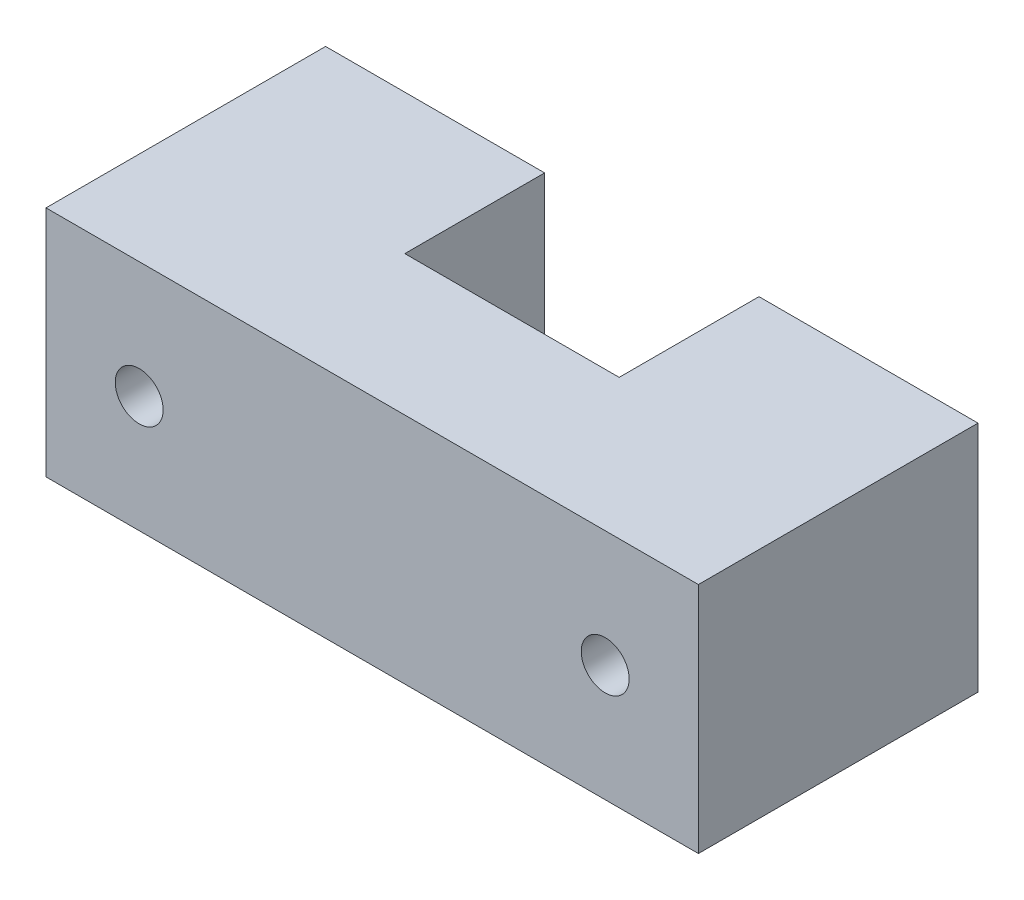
ISO-10303-21;
HEADER;
FILE_DESCRIPTION(('STEP AP214'),'2;1');
FILE_NAME('part.step','',(''),(''),'','','');
FILE_SCHEMA(('AUTOMOTIVE_DESIGN { 1 0 10303 214 1 1 1 1 }'));
ENDSEC;
DATA;
#1=APPLICATION_CONTEXT('core data for automotive mechanical design processes');
#2=APPLICATION_PROTOCOL_DEFINITION('international standard','automotive_design',2000,#1);
#3=PRODUCT_CONTEXT('',#1,'mechanical');
#4=PRODUCT('Part','Part','',(#3));
#5=PRODUCT_RELATED_PRODUCT_CATEGORY('part','',(#4));
#6=PRODUCT_DEFINITION_FORMATION('','',#4);
#7=PRODUCT_DEFINITION_CONTEXT('part definition',#1,'design');
#8=PRODUCT_DEFINITION('design','',#6,#7);
#9=PRODUCT_DEFINITION_SHAPE('','',#8);
#10=(LENGTH_UNIT() NAMED_UNIT(*) SI_UNIT(.MILLI.,.METRE.));
#11=(NAMED_UNIT(*) PLANE_ANGLE_UNIT() SI_UNIT($,.RADIAN.));
#12=(NAMED_UNIT(*) SI_UNIT($,.STERADIAN.) SOLID_ANGLE_UNIT());
#13=UNCERTAINTY_MEASURE_WITH_UNIT(LENGTH_MEASURE(1.E-05),#10,'distance_accuracy_value','');
#14=(GEOMETRIC_REPRESENTATION_CONTEXT(3) GLOBAL_UNCERTAINTY_ASSIGNED_CONTEXT((#13)) GLOBAL_UNIT_ASSIGNED_CONTEXT((#10,
#11,#12)) REPRESENTATION_CONTEXT('',''));
#15=CARTESIAN_POINT('',(0.,0.,0.));
#16=DIRECTION('',(0.,0.,1.));
#17=DIRECTION('',(1.,0.,0.));
#18=AXIS2_PLACEMENT_3D('',#15,#16,#17);
#19=CARTESIAN_POINT('',(0.,0.,0.));
#20=DIRECTION('',(0.,0.,1.));
#21=DIRECTION('',(1.,0.,0.));
#22=AXIS2_PLACEMENT_3D('',#19,#20,#21);
#23=PLANE('',#22);
#24=CARTESIAN_POINT('',(31.75,0.,0.));
#25=DIRECTION('',(0.,0.,1.));
#26=DIRECTION('',(1.,0.,0.));
#27=AXIS2_PLACEMENT_3D('',#24,#25,#26);
#28=CIRCLE('',#27,3.26389999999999);
#29=CARTESIAN_POINT('',(35.0139,0.,0.));
#30=VERTEX_POINT('',#29);
#31=EDGE_CURVE('E155',#30,#30,#28,.T.);
#32=ORIENTED_EDGE('',*,*,#31,.T.);
#33=EDGE_LOOP('',(#32));
#34=FACE_BOUND('',#33,.T.);
#35=DIRECTION('',(1.,0.,0.));
#36=VECTOR('',#35,1.);
#37=CARTESIAN_POINT('',(-44.45,-15.875,0.));
#38=LINE('',#37,#36);
#39=CARTESIAN_POINT('',(14.605,-15.875,0.));
#40=VERTEX_POINT('',#39);
#41=CARTESIAN_POINT('',(44.45,-15.875,0.));
#42=VERTEX_POINT('',#41);
#43=EDGE_CURVE('E78',#40,#42,#38,.T.);
#44=ORIENTED_EDGE('',*,*,#43,.F.);
#45=DIRECTION('',(0.,1.,0.));
#46=VECTOR('',#45,1.);
#47=CARTESIAN_POINT('',(14.605,-15.875,0.));
#48=LINE('',#47,#46);
#49=CARTESIAN_POINT('',(14.605,15.875,0.));
#50=VERTEX_POINT('',#49);
#51=EDGE_CURVE('E107',#40,#50,#48,.T.);
#52=ORIENTED_EDGE('',*,*,#51,.T.);
#53=DIRECTION('',(-1.,0.,0.));
#54=VECTOR('',#53,1.);
#55=CARTESIAN_POINT('',(-44.45,15.875,0.));
#56=LINE('',#55,#54);
#57=CARTESIAN_POINT('',(44.45,15.875,0.));
#58=VERTEX_POINT('',#57);
#59=EDGE_CURVE('E130',#58,#50,#56,.T.);
#60=ORIENTED_EDGE('',*,*,#59,.F.);
#61=DIRECTION('',(0.,1.,0.));
#62=VECTOR('',#61,1.);
#63=CARTESIAN_POINT('',(44.45,15.875,0.));
#64=LINE('',#63,#62);
#65=EDGE_CURVE('E124',#42,#58,#64,.T.);
#66=ORIENTED_EDGE('',*,*,#65,.F.);
#67=EDGE_LOOP('',(#44,#52,#60,#66));
#68=FACE_BOUND('',#67,.T.);
#69=ADVANCED_FACE('F33',(#34,#68),#23,.F.);
#70=CARTESIAN_POINT('',(44.45,15.875,38.1));
#71=DIRECTION('',(-1.,0.,0.));
#72=DIRECTION('',(0.,0.,1.));
#73=AXIS2_PLACEMENT_3D('',#70,#71,#72);
#74=PLANE('',#73);
#75=ORIENTED_EDGE('',*,*,#65,.T.);
#76=DIRECTION('',(0.,0.,-1.));
#77=VECTOR('',#76,1.);
#78=CARTESIAN_POINT('',(44.45,15.875,38.1));
#79=LINE('',#78,#77);
#80=CARTESIAN_POINT('',(44.45,15.875,38.1));
#81=VERTEX_POINT('',#80);
#82=EDGE_CURVE('E11',#81,#58,#79,.T.);
#83=ORIENTED_EDGE('',*,*,#82,.F.);
#84=DIRECTION('',(0.,1.,0.));
#85=VECTOR('',#84,1.);
#86=CARTESIAN_POINT('',(44.45,15.875,38.1));
#87=LINE('',#86,#85);
#88=CARTESIAN_POINT('',(44.45,-15.875,38.1));
#89=VERTEX_POINT('',#88);
#90=EDGE_CURVE('E129',#89,#81,#87,.T.);
#91=ORIENTED_EDGE('',*,*,#90,.F.);
#92=DIRECTION('',(0.,0.,-1.));
#93=VECTOR('',#92,1.);
#94=CARTESIAN_POINT('',(44.45,-15.875,38.1));
#95=LINE('',#94,#93);
#96=EDGE_CURVE('E134',#89,#42,#95,.T.);
#97=ORIENTED_EDGE('',*,*,#96,.T.);
#98=EDGE_LOOP('',(#75,#83,#91,#97));
#99=FACE_BOUND('',#98,.T.);
#100=ADVANCED_FACE('F35',(#99),#74,.F.);
#101=CARTESIAN_POINT('',(-44.45,15.875,38.1));
#102=DIRECTION('',(0.,-1.,0.));
#103=DIRECTION('',(0.,0.,-1.));
#104=AXIS2_PLACEMENT_3D('',#101,#102,#103);
#105=PLANE('',#104);
#106=ORIENTED_EDGE('',*,*,#59,.T.);
#107=DIRECTION('',(0.,0.,-1.));
#108=VECTOR('',#107,1.);
#109=CARTESIAN_POINT('',(14.605,15.875,19.05));
#110=LINE('',#109,#108);
#111=CARTESIAN_POINT('',(14.605,15.875,19.05));
#112=VERTEX_POINT('',#111);
#113=EDGE_CURVE('E112',#112,#50,#110,.T.);
#114=ORIENTED_EDGE('',*,*,#113,.F.);
#115=DIRECTION('',(1.,0.,0.));
#116=VECTOR('',#115,1.);
#117=CARTESIAN_POINT('',(-14.605,15.875,19.05));
#118=LINE('',#117,#116);
#119=CARTESIAN_POINT('',(-14.605,15.875,19.05));
#120=VERTEX_POINT('',#119);
#121=EDGE_CURVE('E120',#120,#112,#118,.T.);
#122=ORIENTED_EDGE('',*,*,#121,.F.);
#123=DIRECTION('',(0.,0.,1.));
#124=VECTOR('',#123,1.);
#125=CARTESIAN_POINT('',(-14.605,15.875,19.05));
#126=LINE('',#125,#124);
#127=CARTESIAN_POINT('',(-14.605,15.875,0.));
#128=VERTEX_POINT('',#127);
#129=EDGE_CURVE('E160',#128,#120,#126,.T.);
#130=ORIENTED_EDGE('',*,*,#129,.F.);
#131=CARTESIAN_POINT('',(-44.45,15.875,0.));
#132=VERTEX_POINT('',#131);
#133=EDGE_CURVE('E149',#128,#132,#56,.T.);
#134=ORIENTED_EDGE('',*,*,#133,.T.);
#135=DIRECTION('',(0.,0.,-1.));
#136=VECTOR('',#135,1.);
#137=CARTESIAN_POINT('',(-44.45,15.875,38.1));
#138=LINE('',#137,#136);
#139=CARTESIAN_POINT('',(-44.45,15.875,38.1));
#140=VERTEX_POINT('',#139);
#141=EDGE_CURVE('E41',#140,#132,#138,.T.);
#142=ORIENTED_EDGE('',*,*,#141,.F.);
#143=DIRECTION('',(-1.,0.,0.));
#144=VECTOR('',#143,1.);
#145=CARTESIAN_POINT('',(-44.45,15.875,38.1));
#146=LINE('',#145,#144);
#147=EDGE_CURVE('E85',#81,#140,#146,.T.);
#148=ORIENTED_EDGE('',*,*,#147,.F.);
#149=ORIENTED_EDGE('',*,*,#82,.T.);
#150=EDGE_LOOP('',(#106,#114,#122,#130,#134,#142,#148,#149));
#151=FACE_BOUND('',#150,.T.);
#152=ADVANCED_FACE('F157',(#151),#105,.F.);
#153=CARTESIAN_POINT('',(-44.45,15.875,38.1));
#154=DIRECTION('',(1.,0.,0.));
#155=DIRECTION('',(0.,0.,-1.));
#156=AXIS2_PLACEMENT_3D('',#153,#154,#155);
#157=PLANE('',#156);
#158=DIRECTION('',(0.,-1.,0.));
#159=VECTOR('',#158,1.);
#160=CARTESIAN_POINT('',(-44.45,15.875,0.));
#161=LINE('',#160,#159);
#162=CARTESIAN_POINT('',(-44.45,-15.875,0.));
#163=VERTEX_POINT('',#162);
#164=EDGE_CURVE('E126',#132,#163,#161,.T.);
#165=ORIENTED_EDGE('',*,*,#164,.T.);
#166=DIRECTION('',(0.,0.,-1.));
#167=VECTOR('',#166,1.);
#168=CARTESIAN_POINT('',(-44.45,-15.875,38.1));
#169=LINE('',#168,#167);
#170=CARTESIAN_POINT('',(-44.45,-15.875,38.1));
#171=VERTEX_POINT('',#170);
#172=EDGE_CURVE('E136',#171,#163,#169,.T.);
#173=ORIENTED_EDGE('',*,*,#172,.F.);
#174=DIRECTION('',(0.,-1.,0.));
#175=VECTOR('',#174,1.);
#176=CARTESIAN_POINT('',(-44.45,15.875,38.1));
#177=LINE('',#176,#175);
#178=EDGE_CURVE('E144',#140,#171,#177,.T.);
#179=ORIENTED_EDGE('',*,*,#178,.F.);
#180=ORIENTED_EDGE('',*,*,#141,.T.);
#181=EDGE_LOOP('',(#165,#173,#179,#180));
#182=FACE_BOUND('',#181,.T.);
#183=ADVANCED_FACE('F142',(#182),#157,.F.);
#184=CARTESIAN_POINT('',(-44.45,-15.875,38.1));
#185=DIRECTION('',(0.,1.,0.));
#186=DIRECTION('',(0.,0.,1.));
#187=AXIS2_PLACEMENT_3D('',#184,#185,#186);
#188=PLANE('',#187);
#189=DIRECTION('',(1.,0.,0.));
#190=VECTOR('',#189,1.);
#191=CARTESIAN_POINT('',(-14.605,-15.875,19.05));
#192=LINE('',#191,#190);
#193=CARTESIAN_POINT('',(-14.605,-15.875,19.05));
#194=VERTEX_POINT('',#193);
#195=CARTESIAN_POINT('',(14.605,-15.875,19.05));
#196=VERTEX_POINT('',#195);
#197=EDGE_CURVE('E116',#194,#196,#192,.T.);
#198=ORIENTED_EDGE('',*,*,#197,.T.);
#199=DIRECTION('',(0.,0.,-1.));
#200=VECTOR('',#199,1.);
#201=CARTESIAN_POINT('',(14.605,-15.875,19.05));
#202=LINE('',#201,#200);
#203=EDGE_CURVE('E109',#196,#40,#202,.T.);
#204=ORIENTED_EDGE('',*,*,#203,.T.);
#205=ORIENTED_EDGE('',*,*,#43,.T.);
#206=ORIENTED_EDGE('',*,*,#96,.F.);
#207=DIRECTION('',(1.,0.,0.));
#208=VECTOR('',#207,1.);
#209=CARTESIAN_POINT('',(-44.45,-15.875,38.1));
#210=LINE('',#209,#208);
#211=EDGE_CURVE('E57',#171,#89,#210,.T.);
#212=ORIENTED_EDGE('',*,*,#211,.F.);
#213=ORIENTED_EDGE('',*,*,#172,.T.);
#214=CARTESIAN_POINT('',(-14.605,-15.875,0.));
#215=VERTEX_POINT('',#214);
#216=EDGE_CURVE('E125',#163,#215,#38,.T.);
#217=ORIENTED_EDGE('',*,*,#216,.T.);
#218=DIRECTION('',(0.,0.,1.));
#219=VECTOR('',#218,1.);
#220=CARTESIAN_POINT('',(-14.605,-15.875,19.05));
#221=LINE('',#220,#219);
#222=EDGE_CURVE('E48',#215,#194,#221,.T.);
#223=ORIENTED_EDGE('',*,*,#222,.T.);
#224=EDGE_LOOP('',(#198,#204,#205,#206,#212,#213,#217,#223));
#225=FACE_BOUND('',#224,.T.);
#226=ADVANCED_FACE('F118',(#225),#188,.F.);
#227=CARTESIAN_POINT('',(0.,0.,38.1));
#228=DIRECTION('',(0.,0.,1.));
#229=DIRECTION('',(1.,0.,0.));
#230=AXIS2_PLACEMENT_3D('',#227,#228,#229);
#231=PLANE('',#230);
#232=CARTESIAN_POINT('',(-31.75,0.,38.1));
#233=DIRECTION('',(0.,0.,1.));
#234=DIRECTION('',(1.,0.,0.));
#235=AXIS2_PLACEMENT_3D('',#232,#233,#234);
#236=CIRCLE('',#235,3.2639);
#237=CARTESIAN_POINT('',(-28.4861,0.,38.1));
#238=VERTEX_POINT('',#237);
#239=EDGE_CURVE('E169',#238,#238,#236,.T.);
#240=ORIENTED_EDGE('',*,*,#239,.F.);
#241=EDGE_LOOP('',(#240));
#242=FACE_BOUND('',#241,.T.);
#243=CARTESIAN_POINT('',(31.75,0.,38.1));
#244=DIRECTION('',(0.,0.,1.));
#245=DIRECTION('',(1.,0.,0.));
#246=AXIS2_PLACEMENT_3D('',#243,#244,#245);
#247=CIRCLE('',#246,3.2639);
#248=CARTESIAN_POINT('',(35.0139,0.,38.1));
#249=VERTEX_POINT('',#248);
#250=EDGE_CURVE('E178',#249,#249,#247,.T.);
#251=ORIENTED_EDGE('',*,*,#250,.F.);
#252=EDGE_LOOP('',(#251));
#253=FACE_BOUND('',#252,.T.);
#254=ORIENTED_EDGE('',*,*,#90,.T.);
#255=ORIENTED_EDGE('',*,*,#147,.T.);
#256=ORIENTED_EDGE('',*,*,#178,.T.);
#257=ORIENTED_EDGE('',*,*,#211,.T.);
#258=EDGE_LOOP('',(#254,#255,#256,#257));
#259=FACE_BOUND('',#258,.T.);
#260=ADVANCED_FACE('F183',(#242,#253,#259),#231,.T.);
#261=CARTESIAN_POINT('',(-31.75,0.,0.));
#262=DIRECTION('',(0.,0.,1.));
#263=DIRECTION('',(1.,0.,0.));
#264=AXIS2_PLACEMENT_3D('',#261,#262,#263);
#265=CIRCLE('',#264,3.26389999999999);
#266=CARTESIAN_POINT('',(-28.4861,0.,0.));
#267=VERTEX_POINT('',#266);
#268=EDGE_CURVE('E175',#267,#267,#265,.T.);
#269=ORIENTED_EDGE('',*,*,#268,.T.);
#270=EDGE_LOOP('',(#269));
#271=FACE_BOUND('',#270,.T.);
#272=ORIENTED_EDGE('',*,*,#133,.F.);
#273=DIRECTION('',(0.,1.,0.));
#274=VECTOR('',#273,1.);
#275=CARTESIAN_POINT('',(-14.605,-15.875,0.));
#276=LINE('',#275,#274);
#277=EDGE_CURVE('E115',#215,#128,#276,.T.);
#278=ORIENTED_EDGE('',*,*,#277,.F.);
#279=ORIENTED_EDGE('',*,*,#216,.F.);
#280=ORIENTED_EDGE('',*,*,#164,.F.);
#281=EDGE_LOOP('',(#272,#278,#279,#280));
#282=FACE_BOUND('',#281,.T.);
#283=ADVANCED_FACE('F148',(#271,#282),#23,.F.);
#284=CARTESIAN_POINT('',(31.75,0.,38.1));
#285=DIRECTION('',(0.,0.,1.));
#286=DIRECTION('',(1.,0.,0.));
#287=AXIS2_PLACEMENT_3D('',#284,#285,#286);
#288=CYLINDRICAL_SURFACE('',#287,3.2639);
#289=ORIENTED_EDGE('',*,*,#31,.F.);
#290=EDGE_LOOP('',(#289));
#291=FACE_BOUND('',#290,.T.);
#292=ORIENTED_EDGE('',*,*,#250,.T.);
#293=EDGE_LOOP('',(#292));
#294=FACE_BOUND('',#293,.T.);
#295=ADVANCED_FACE('F200',(#291,#294),#288,.F.);
#296=CARTESIAN_POINT('',(-31.75,0.,38.1));
#297=DIRECTION('',(0.,0.,1.));
#298=DIRECTION('',(1.,0.,0.));
#299=AXIS2_PLACEMENT_3D('',#296,#297,#298);
#300=CYLINDRICAL_SURFACE('',#299,3.2639);
#301=ORIENTED_EDGE('',*,*,#268,.F.);
#302=EDGE_LOOP('',(#301));
#303=FACE_BOUND('',#302,.T.);
#304=ORIENTED_EDGE('',*,*,#239,.T.);
#305=EDGE_LOOP('',(#304));
#306=FACE_BOUND('',#305,.T.);
#307=ADVANCED_FACE('F207',(#303,#306),#300,.F.);
#308=CARTESIAN_POINT('',(14.605,-15.875,19.05));
#309=DIRECTION('',(1.,0.,0.));
#310=DIRECTION('',(0.,0.,-1.));
#311=AXIS2_PLACEMENT_3D('',#308,#309,#310);
#312=PLANE('',#311);
#313=ORIENTED_EDGE('',*,*,#113,.T.);
#314=ORIENTED_EDGE('',*,*,#51,.F.);
#315=ORIENTED_EDGE('',*,*,#203,.F.);
#316=DIRECTION('',(0.,1.,0.));
#317=VECTOR('',#316,1.);
#318=CARTESIAN_POINT('',(14.605,-15.875,19.05));
#319=LINE('',#318,#317);
#320=EDGE_CURVE('E167',#196,#112,#319,.T.);
#321=ORIENTED_EDGE('',*,*,#320,.T.);
#322=EDGE_LOOP('',(#313,#314,#315,#321));
#323=FACE_BOUND('',#322,.T.);
#324=ADVANCED_FACE('F108',(#323),#312,.F.);
#325=CARTESIAN_POINT('',(-14.605,-15.875,19.05));
#326=DIRECTION('',(0.,0.,1.));
#327=DIRECTION('',(1.,0.,0.));
#328=AXIS2_PLACEMENT_3D('',#325,#326,#327);
#329=PLANE('',#328);
#330=ORIENTED_EDGE('',*,*,#121,.T.);
#331=ORIENTED_EDGE('',*,*,#320,.F.);
#332=ORIENTED_EDGE('',*,*,#197,.F.);
#333=DIRECTION('',(0.,1.,0.));
#334=VECTOR('',#333,1.);
#335=CARTESIAN_POINT('',(-14.605,-15.875,19.05));
#336=LINE('',#335,#334);
#337=EDGE_CURVE('E170',#194,#120,#336,.T.);
#338=ORIENTED_EDGE('',*,*,#337,.T.);
#339=EDGE_LOOP('',(#330,#331,#332,#338));
#340=FACE_BOUND('',#339,.T.);
#341=ADVANCED_FACE('F223',(#340),#329,.F.);
#342=CARTESIAN_POINT('',(-14.605,-15.875,19.05));
#343=DIRECTION('',(-1.,0.,0.));
#344=DIRECTION('',(0.,0.,1.));
#345=AXIS2_PLACEMENT_3D('',#342,#343,#344);
#346=PLANE('',#345);
#347=ORIENTED_EDGE('',*,*,#129,.T.);
#348=ORIENTED_EDGE('',*,*,#337,.F.);
#349=ORIENTED_EDGE('',*,*,#222,.F.);
#350=ORIENTED_EDGE('',*,*,#277,.T.);
#351=EDGE_LOOP('',(#347,#348,#349,#350));
#352=FACE_BOUND('',#351,.T.);
#353=ADVANCED_FACE('F226',(#352),#346,.F.);
#354=CLOSED_SHELL('',(#69,#100,#152,#183,#226,#260,#283,#295,#307,#324,#341,#353));
#355=MANIFOLD_SOLID_BREP('B2',#354);
#356=ADVANCED_BREP_SHAPE_REPRESENTATION('',(#18,#355),#14);
#357=SHAPE_DEFINITION_REPRESENTATION(#9,#356);
ENDSEC;
END-ISO-10303-21;
